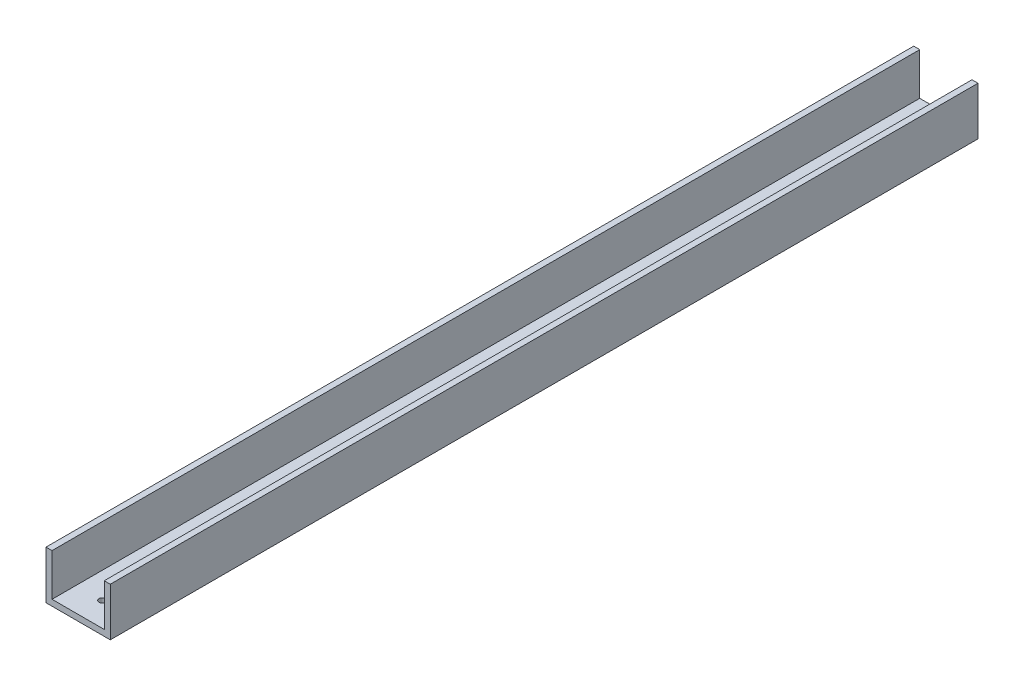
ISO-10303-21;
HEADER;
FILE_DESCRIPTION(('STEP AP214'),'2;1');
FILE_NAME('part.step','',(''),(''),'','','');
FILE_SCHEMA(('AUTOMOTIVE_DESIGN { 1 0 10303 214 1 1 1 1 }'));
ENDSEC;
DATA;
#1=APPLICATION_CONTEXT('core data for automotive mechanical design processes');
#2=APPLICATION_PROTOCOL_DEFINITION('international standard','automotive_design',2000,#1);
#3=PRODUCT_CONTEXT('',#1,'mechanical');
#4=PRODUCT('Part','Part','',(#3));
#5=PRODUCT_RELATED_PRODUCT_CATEGORY('part','',(#4));
#6=PRODUCT_DEFINITION_FORMATION('','',#4);
#7=PRODUCT_DEFINITION_CONTEXT('part definition',#1,'design');
#8=PRODUCT_DEFINITION('design','',#6,#7);
#9=PRODUCT_DEFINITION_SHAPE('','',#8);
#10=(LENGTH_UNIT() NAMED_UNIT(*) SI_UNIT(.MILLI.,.METRE.));
#11=(NAMED_UNIT(*) PLANE_ANGLE_UNIT() SI_UNIT($,.RADIAN.));
#12=(NAMED_UNIT(*) SI_UNIT($,.STERADIAN.) SOLID_ANGLE_UNIT());
#13=UNCERTAINTY_MEASURE_WITH_UNIT(LENGTH_MEASURE(1.E-05),#10,'distance_accuracy_value','');
#14=(GEOMETRIC_REPRESENTATION_CONTEXT(3) GLOBAL_UNCERTAINTY_ASSIGNED_CONTEXT((#13)) GLOBAL_UNIT_ASSIGNED_CONTEXT((#10,
#11,#12)) REPRESENTATION_CONTEXT('',''));
#15=CARTESIAN_POINT('',(0.,0.,0.));
#16=DIRECTION('',(0.,0.,1.));
#17=DIRECTION('',(1.,0.,0.));
#18=AXIS2_PLACEMENT_3D('',#15,#16,#17);
#19=CARTESIAN_POINT('',(-20.6375,38.1,-342.9));
#20=DIRECTION('',(0.,1.,0.));
#21=DIRECTION('',(-1.,0.,0.));
#22=AXIS2_PLACEMENT_3D('',#19,#20,#21);
#23=PLANE('',#22);
#24=DIRECTION('',(0.,0.,1.));
#25=VECTOR('',#24,1.);
#26=CARTESIAN_POINT('',(-25.4,38.1,-342.9));
#27=LINE('',#26,#25);
#28=CARTESIAN_POINT('',(-25.4,38.1,-342.9));
#29=VERTEX_POINT('',#28);
#30=CARTESIAN_POINT('',(-25.4,38.1,342.9));
#31=VERTEX_POINT('',#30);
#32=EDGE_CURVE('E95',#29,#31,#27,.T.);
#33=ORIENTED_EDGE('',*,*,#32,.T.);
#34=DIRECTION('',(-1.,0.,0.));
#35=VECTOR('',#34,1.);
#36=CARTESIAN_POINT('',(-20.6375,38.1,342.9));
#37=LINE('',#36,#35);
#38=CARTESIAN_POINT('',(-20.6375,38.1,342.9));
#39=VERTEX_POINT('',#38);
#40=EDGE_CURVE('E98',#39,#31,#37,.T.);
#41=ORIENTED_EDGE('',*,*,#40,.F.);
#42=DIRECTION('',(0.,0.,1.));
#43=VECTOR('',#42,1.);
#44=CARTESIAN_POINT('',(-20.6375,38.1,-342.9));
#45=LINE('',#44,#43);
#46=CARTESIAN_POINT('',(-20.6375,38.1,-342.9));
#47=VERTEX_POINT('',#46);
#48=EDGE_CURVE('E11',#47,#39,#45,.T.);
#49=ORIENTED_EDGE('',*,*,#48,.F.);
#50=DIRECTION('',(-1.,0.,0.));
#51=VECTOR('',#50,1.);
#52=CARTESIAN_POINT('',(-20.6375,38.1,-342.9));
#53=LINE('',#52,#51);
#54=EDGE_CURVE('E99',#47,#29,#53,.T.);
#55=ORIENTED_EDGE('',*,*,#54,.T.);
#56=EDGE_LOOP('',(#33,#41,#49,#55));
#57=FACE_BOUND('',#56,.T.);
#58=ADVANCED_FACE('F33',(#57),#23,.T.);
#59=CARTESIAN_POINT('',(-20.6375,4.76249999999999,-342.9));
#60=DIRECTION('',(1.,0.,0.));
#61=DIRECTION('',(0.,1.,0.));
#62=AXIS2_PLACEMENT_3D('',#59,#60,#61);
#63=PLANE('',#62);
#64=ORIENTED_EDGE('',*,*,#48,.T.);
#65=DIRECTION('',(0.,1.,0.));
#66=VECTOR('',#65,1.);
#67=CARTESIAN_POINT('',(-20.6375,4.76249999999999,342.9));
#68=LINE('',#67,#66);
#69=CARTESIAN_POINT('',(-20.6375,4.76249999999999,342.9));
#70=VERTEX_POINT('',#69);
#71=EDGE_CURVE('E116',#70,#39,#68,.T.);
#72=ORIENTED_EDGE('',*,*,#71,.F.);
#73=DIRECTION('',(0.,0.,1.));
#74=VECTOR('',#73,1.);
#75=CARTESIAN_POINT('',(-20.6375,4.76249999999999,-342.9));
#76=LINE('',#75,#74);
#77=CARTESIAN_POINT('',(-20.6375,4.76249999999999,-342.9));
#78=VERTEX_POINT('',#77);
#79=EDGE_CURVE('E41',#78,#70,#76,.T.);
#80=ORIENTED_EDGE('',*,*,#79,.F.);
#81=DIRECTION('',(0.,1.,0.));
#82=VECTOR('',#81,1.);
#83=CARTESIAN_POINT('',(-20.6375,4.76249999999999,-342.9));
#84=LINE('',#83,#82);
#85=EDGE_CURVE('E104',#78,#47,#84,.T.);
#86=ORIENTED_EDGE('',*,*,#85,.T.);
#87=EDGE_LOOP('',(#64,#72,#80,#86));
#88=FACE_BOUND('',#87,.T.);
#89=ADVANCED_FACE('F186',(#88),#63,.T.);
#90=CARTESIAN_POINT('',(20.6375,4.7625,-342.9));
#91=DIRECTION('',(0.,1.,0.));
#92=DIRECTION('',(-1.,0.,0.));
#93=AXIS2_PLACEMENT_3D('',#90,#91,#92);
#94=PLANE('',#93);
#95=CARTESIAN_POINT('',(0.,4.7625,323.85));
#96=DIRECTION('',(0.,1.,0.));
#97=DIRECTION('',(-1.,0.,0.));
#98=AXIS2_PLACEMENT_3D('',#95,#96,#97);
#99=CIRCLE('',#98,2.55269999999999);
#100=CARTESIAN_POINT('',(-2.55269999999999,4.7625,323.85));
#101=VERTEX_POINT('',#100);
#102=EDGE_CURVE('E236',#101,#101,#99,.T.);
#103=ORIENTED_EDGE('',*,*,#102,.F.);
#104=EDGE_LOOP('',(#103));
#105=FACE_BOUND('',#104,.T.);
#106=CARTESIAN_POINT('',(0.,4.7625,101.6));
#107=DIRECTION('',(0.,1.,0.));
#108=DIRECTION('',(-1.,0.,0.));
#109=AXIS2_PLACEMENT_3D('',#106,#107,#108);
#110=CIRCLE('',#109,2.55269999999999);
#111=CARTESIAN_POINT('',(-2.55269999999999,4.7625,101.6));
#112=VERTEX_POINT('',#111);
#113=EDGE_CURVE('E246',#112,#112,#110,.T.);
#114=ORIENTED_EDGE('',*,*,#113,.F.);
#115=EDGE_LOOP('',(#114));
#116=FACE_BOUND('',#115,.T.);
#117=CARTESIAN_POINT('',(0.,4.7625,-101.6));
#118=DIRECTION('',(0.,1.,0.));
#119=DIRECTION('',(-1.,0.,0.));
#120=AXIS2_PLACEMENT_3D('',#117,#118,#119);
#121=CIRCLE('',#120,2.55269999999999);
#122=CARTESIAN_POINT('',(-2.55269999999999,4.7625,-101.6));
#123=VERTEX_POINT('',#122);
#124=EDGE_CURVE('E36',#123,#123,#121,.T.);
#125=ORIENTED_EDGE('',*,*,#124,.F.);
#126=EDGE_LOOP('',(#125));
#127=FACE_BOUND('',#126,.T.);
#128=CARTESIAN_POINT('',(0.,4.7625,-323.85));
#129=DIRECTION('',(0.,1.,0.));
#130=DIRECTION('',(-1.,0.,0.));
#131=AXIS2_PLACEMENT_3D('',#128,#129,#130);
#132=CIRCLE('',#131,2.55269999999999);
#133=CARTESIAN_POINT('',(-2.55269999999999,4.7625,-323.85));
#134=VERTEX_POINT('',#133);
#135=EDGE_CURVE('E117',#134,#134,#132,.T.);
#136=ORIENTED_EDGE('',*,*,#135,.F.);
#137=EDGE_LOOP('',(#136));
#138=FACE_BOUND('',#137,.T.);
#139=ORIENTED_EDGE('',*,*,#79,.T.);
#140=DIRECTION('',(-1.,0.,0.));
#141=VECTOR('',#140,1.);
#142=CARTESIAN_POINT('',(20.6375,4.7625,342.9));
#143=LINE('',#142,#141);
#144=CARTESIAN_POINT('',(20.6375,4.7625,342.9));
#145=VERTEX_POINT('',#144);
#146=EDGE_CURVE('E134',#145,#70,#143,.T.);
#147=ORIENTED_EDGE('',*,*,#146,.F.);
#148=DIRECTION('',(0.,0.,1.));
#149=VECTOR('',#148,1.);
#150=CARTESIAN_POINT('',(20.6375,4.7625,-342.9));
#151=LINE('',#150,#149);
#152=CARTESIAN_POINT('',(20.6375,4.7625,-342.9));
#153=VERTEX_POINT('',#152);
#154=EDGE_CURVE('E156',#153,#145,#151,.T.);
#155=ORIENTED_EDGE('',*,*,#154,.F.);
#156=DIRECTION('',(-1.,0.,0.));
#157=VECTOR('',#156,1.);
#158=CARTESIAN_POINT('',(20.6375,4.7625,-342.9));
#159=LINE('',#158,#157);
#160=EDGE_CURVE('E152',#153,#78,#159,.T.);
#161=ORIENTED_EDGE('',*,*,#160,.T.);
#162=EDGE_LOOP('',(#139,#147,#155,#161));
#163=FACE_BOUND('',#162,.T.);
#164=ADVANCED_FACE('F185',(#105,#116,#127,#138,#163),#94,.T.);
#165=CARTESIAN_POINT('',(20.6375,38.1,-342.9));
#166=DIRECTION('',(-1.,0.,0.));
#167=DIRECTION('',(0.,-1.,0.));
#168=AXIS2_PLACEMENT_3D('',#165,#166,#167);
#169=PLANE('',#168);
#170=ORIENTED_EDGE('',*,*,#154,.T.);
#171=DIRECTION('',(0.,-1.,0.));
#172=VECTOR('',#171,1.);
#173=CARTESIAN_POINT('',(20.6375,38.1,342.9));
#174=LINE('',#173,#172);
#175=CARTESIAN_POINT('',(20.6375,38.1,342.9));
#176=VERTEX_POINT('',#175);
#177=EDGE_CURVE('E131',#176,#145,#174,.T.);
#178=ORIENTED_EDGE('',*,*,#177,.F.);
#179=DIRECTION('',(0.,0.,1.));
#180=VECTOR('',#179,1.);
#181=CARTESIAN_POINT('',(20.6375,38.1,-342.9));
#182=LINE('',#181,#180);
#183=CARTESIAN_POINT('',(20.6375,38.1,-342.9));
#184=VERTEX_POINT('',#183);
#185=EDGE_CURVE('E158',#184,#176,#182,.T.);
#186=ORIENTED_EDGE('',*,*,#185,.F.);
#187=DIRECTION('',(0.,-1.,0.));
#188=VECTOR('',#187,1.);
#189=CARTESIAN_POINT('',(20.6375,38.1,-342.9));
#190=LINE('',#189,#188);
#191=EDGE_CURVE('E149',#184,#153,#190,.T.);
#192=ORIENTED_EDGE('',*,*,#191,.T.);
#193=EDGE_LOOP('',(#170,#178,#186,#192));
#194=FACE_BOUND('',#193,.T.);
#195=ADVANCED_FACE('F181',(#194),#169,.T.);
#196=CARTESIAN_POINT('',(25.4,38.1,-342.9));
#197=DIRECTION('',(0.,1.,0.));
#198=DIRECTION('',(-1.,0.,0.));
#199=AXIS2_PLACEMENT_3D('',#196,#197,#198);
#200=PLANE('',#199);
#201=ORIENTED_EDGE('',*,*,#185,.T.);
#202=DIRECTION('',(-1.,0.,0.));
#203=VECTOR('',#202,1.);
#204=CARTESIAN_POINT('',(25.4,38.1,342.9));
#205=LINE('',#204,#203);
#206=CARTESIAN_POINT('',(25.4,38.1,342.9));
#207=VERTEX_POINT('',#206);
#208=EDGE_CURVE('E128',#207,#176,#205,.T.);
#209=ORIENTED_EDGE('',*,*,#208,.F.);
#210=DIRECTION('',(0.,0.,1.));
#211=VECTOR('',#210,1.);
#212=CARTESIAN_POINT('',(25.4,38.1,-342.9));
#213=LINE('',#212,#211);
#214=CARTESIAN_POINT('',(25.4,38.1,-342.9));
#215=VERTEX_POINT('',#214);
#216=EDGE_CURVE('E160',#215,#207,#213,.T.);
#217=ORIENTED_EDGE('',*,*,#216,.F.);
#218=DIRECTION('',(-1.,0.,0.));
#219=VECTOR('',#218,1.);
#220=CARTESIAN_POINT('',(25.4,38.1,-342.9));
#221=LINE('',#220,#219);
#222=EDGE_CURVE('E146',#215,#184,#221,.T.);
#223=ORIENTED_EDGE('',*,*,#222,.T.);
#224=EDGE_LOOP('',(#201,#209,#217,#223));
#225=FACE_BOUND('',#224,.T.);
#226=ADVANCED_FACE('F174',(#225),#200,.T.);
#227=CARTESIAN_POINT('',(25.4,0.,-342.9));
#228=DIRECTION('',(1.,0.,0.));
#229=DIRECTION('',(0.,1.,0.));
#230=AXIS2_PLACEMENT_3D('',#227,#228,#229);
#231=PLANE('',#230);
#232=ORIENTED_EDGE('',*,*,#216,.T.);
#233=DIRECTION('',(0.,1.,0.));
#234=VECTOR('',#233,1.);
#235=CARTESIAN_POINT('',(25.4,0.,342.9));
#236=LINE('',#235,#234);
#237=CARTESIAN_POINT('',(25.4,0.,342.9));
#238=VERTEX_POINT('',#237);
#239=EDGE_CURVE('E125',#238,#207,#236,.T.);
#240=ORIENTED_EDGE('',*,*,#239,.F.);
#241=DIRECTION('',(0.,0.,1.));
#242=VECTOR('',#241,1.);
#243=CARTESIAN_POINT('',(25.4,0.,-342.9));
#244=LINE('',#243,#242);
#245=CARTESIAN_POINT('',(25.4,0.,-342.9));
#246=VERTEX_POINT('',#245);
#247=EDGE_CURVE('E162',#246,#238,#244,.T.);
#248=ORIENTED_EDGE('',*,*,#247,.F.);
#249=DIRECTION('',(0.,1.,0.));
#250=VECTOR('',#249,1.);
#251=CARTESIAN_POINT('',(25.4,0.,-342.9));
#252=LINE('',#251,#250);
#253=EDGE_CURVE('E143',#246,#215,#252,.T.);
#254=ORIENTED_EDGE('',*,*,#253,.T.);
#255=EDGE_LOOP('',(#232,#240,#248,#254));
#256=FACE_BOUND('',#255,.T.);
#257=ADVANCED_FACE('F171',(#256),#231,.T.);
#258=CARTESIAN_POINT('',(-25.4,0.,-342.9));
#259=DIRECTION('',(0.,-1.,0.));
#260=DIRECTION('',(1.,0.,0.));
#261=AXIS2_PLACEMENT_3D('',#258,#259,#260);
#262=PLANE('',#261);
#263=CARTESIAN_POINT('',(0.,0.,323.85));
#264=DIRECTION('',(0.,-1.,0.));
#265=DIRECTION('',(0.,0.,-1.));
#266=AXIS2_PLACEMENT_3D('',#263,#264,#265);
#267=CIRCLE('',#266,2.55269999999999);
#268=CARTESIAN_POINT('',(0.,0.,321.2973));
#269=VERTEX_POINT('',#268);
#270=EDGE_CURVE('E239',#269,#269,#267,.T.);
#271=ORIENTED_EDGE('',*,*,#270,.F.);
#272=EDGE_LOOP('',(#271));
#273=FACE_BOUND('',#272,.T.);
#274=CARTESIAN_POINT('',(0.,0.,101.6));
#275=DIRECTION('',(0.,-1.,0.));
#276=DIRECTION('',(0.,0.,-1.));
#277=AXIS2_PLACEMENT_3D('',#274,#275,#276);
#278=CIRCLE('',#277,2.55269999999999);
#279=CARTESIAN_POINT('',(0.,0.,99.0473));
#280=VERTEX_POINT('',#279);
#281=EDGE_CURVE('E241',#280,#280,#278,.T.);
#282=ORIENTED_EDGE('',*,*,#281,.F.);
#283=EDGE_LOOP('',(#282));
#284=FACE_BOUND('',#283,.T.);
#285=CARTESIAN_POINT('',(0.,0.,-101.6));
#286=DIRECTION('',(0.,-1.,0.));
#287=DIRECTION('',(0.,0.,-1.));
#288=AXIS2_PLACEMENT_3D('',#285,#286,#287);
#289=CIRCLE('',#288,2.55269999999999);
#290=CARTESIAN_POINT('',(0.,0.,-104.1527));
#291=VERTEX_POINT('',#290);
#292=EDGE_CURVE('E249',#291,#291,#289,.T.);
#293=ORIENTED_EDGE('',*,*,#292,.F.);
#294=EDGE_LOOP('',(#293));
#295=FACE_BOUND('',#294,.T.);
#296=CARTESIAN_POINT('',(0.,0.,-323.85));
#297=DIRECTION('',(0.,-1.,0.));
#298=DIRECTION('',(0.,0.,-1.));
#299=AXIS2_PLACEMENT_3D('',#296,#297,#298);
#300=CIRCLE('',#299,2.55269999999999);
#301=CARTESIAN_POINT('',(0.,0.,-326.4027));
#302=VERTEX_POINT('',#301);
#303=EDGE_CURVE('E120',#302,#302,#300,.T.);
#304=ORIENTED_EDGE('',*,*,#303,.F.);
#305=EDGE_LOOP('',(#304));
#306=FACE_BOUND('',#305,.T.);
#307=ORIENTED_EDGE('',*,*,#247,.T.);
#308=DIRECTION('',(1.,0.,0.));
#309=VECTOR('',#308,1.);
#310=CARTESIAN_POINT('',(-25.4,0.,342.9));
#311=LINE('',#310,#309);
#312=CARTESIAN_POINT('',(-25.4,0.,342.9));
#313=VERTEX_POINT('',#312);
#314=EDGE_CURVE('E111',#313,#238,#311,.T.);
#315=ORIENTED_EDGE('',*,*,#314,.F.);
#316=DIRECTION('',(0.,0.,1.));
#317=VECTOR('',#316,1.);
#318=CARTESIAN_POINT('',(-25.4,0.,-342.9));
#319=LINE('',#318,#317);
#320=CARTESIAN_POINT('',(-25.4,0.,-342.9));
#321=VERTEX_POINT('',#320);
#322=EDGE_CURVE('E103',#321,#313,#319,.T.);
#323=ORIENTED_EDGE('',*,*,#322,.F.);
#324=DIRECTION('',(1.,0.,0.));
#325=VECTOR('',#324,1.);
#326=CARTESIAN_POINT('',(-25.4,0.,-342.9));
#327=LINE('',#326,#325);
#328=EDGE_CURVE('E140',#321,#246,#327,.T.);
#329=ORIENTED_EDGE('',*,*,#328,.T.);
#330=EDGE_LOOP('',(#307,#315,#323,#329));
#331=FACE_BOUND('',#330,.T.);
#332=ADVANCED_FACE('F165',(#273,#284,#295,#306,#331),#262,.T.);
#333=CARTESIAN_POINT('',(-25.4,38.1,-342.9));
#334=DIRECTION('',(-1.,0.,0.));
#335=DIRECTION('',(0.,-1.,0.));
#336=AXIS2_PLACEMENT_3D('',#333,#334,#335);
#337=PLANE('',#336);
#338=ORIENTED_EDGE('',*,*,#322,.T.);
#339=DIRECTION('',(0.,-1.,0.));
#340=VECTOR('',#339,1.);
#341=CARTESIAN_POINT('',(-25.4,38.1,342.9));
#342=LINE('',#341,#340);
#343=EDGE_CURVE('E106',#31,#313,#342,.T.);
#344=ORIENTED_EDGE('',*,*,#343,.F.);
#345=ORIENTED_EDGE('',*,*,#32,.F.);
#346=DIRECTION('',(0.,-1.,0.));
#347=VECTOR('',#346,1.);
#348=CARTESIAN_POINT('',(-25.4,38.1,-342.9));
#349=LINE('',#348,#347);
#350=EDGE_CURVE('E138',#29,#321,#349,.T.);
#351=ORIENTED_EDGE('',*,*,#350,.T.);
#352=EDGE_LOOP('',(#338,#344,#345,#351));
#353=FACE_BOUND('',#352,.T.);
#354=ADVANCED_FACE('F107',(#353),#337,.T.);
#355=CARTESIAN_POINT('',(0.,0.,-342.9));
#356=DIRECTION('',(0.,0.,1.));
#357=DIRECTION('',(1.,0.,0.));
#358=AXIS2_PLACEMENT_3D('',#355,#356,#357);
#359=PLANE('',#358);
#360=ORIENTED_EDGE('',*,*,#54,.F.);
#361=ORIENTED_EDGE('',*,*,#85,.F.);
#362=ORIENTED_EDGE('',*,*,#160,.F.);
#363=ORIENTED_EDGE('',*,*,#191,.F.);
#364=ORIENTED_EDGE('',*,*,#222,.F.);
#365=ORIENTED_EDGE('',*,*,#253,.F.);
#366=ORIENTED_EDGE('',*,*,#328,.F.);
#367=ORIENTED_EDGE('',*,*,#350,.F.);
#368=EDGE_LOOP('',(#360,#361,#362,#363,#364,#365,#366,#367));
#369=FACE_BOUND('',#368,.T.);
#370=ADVANCED_FACE('F177',(#369),#359,.F.);
#371=CARTESIAN_POINT('',(0.,0.,342.9));
#372=DIRECTION('',(0.,0.,1.));
#373=DIRECTION('',(1.,0.,0.));
#374=AXIS2_PLACEMENT_3D('',#371,#372,#373);
#375=PLANE('',#374);
#376=ORIENTED_EDGE('',*,*,#40,.T.);
#377=ORIENTED_EDGE('',*,*,#343,.T.);
#378=ORIENTED_EDGE('',*,*,#314,.T.);
#379=ORIENTED_EDGE('',*,*,#239,.T.);
#380=ORIENTED_EDGE('',*,*,#208,.T.);
#381=ORIENTED_EDGE('',*,*,#177,.T.);
#382=ORIENTED_EDGE('',*,*,#146,.T.);
#383=ORIENTED_EDGE('',*,*,#71,.T.);
#384=EDGE_LOOP('',(#376,#377,#378,#379,#380,#381,#382,#383));
#385=FACE_BOUND('',#384,.T.);
#386=ADVANCED_FACE('F114',(#385),#375,.T.);
#387=CARTESIAN_POINT('',(0.,0.,-323.85));
#388=DIRECTION('',(0.,-1.,0.));
#389=DIRECTION('',(0.,0.,-1.));
#390=AXIS2_PLACEMENT_3D('',#387,#388,#389);
#391=CYLINDRICAL_SURFACE('',#390,2.55269999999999);
#392=ORIENTED_EDGE('',*,*,#135,.T.);
#393=EDGE_LOOP('',(#392));
#394=FACE_BOUND('',#393,.T.);
#395=ORIENTED_EDGE('',*,*,#303,.T.);
#396=EDGE_LOOP('',(#395));
#397=FACE_BOUND('',#396,.T.);
#398=ADVANCED_FACE('F213',(#394,#397),#391,.F.);
#399=CARTESIAN_POINT('',(0.,0.,-101.6));
#400=DIRECTION('',(0.,-1.,0.));
#401=DIRECTION('',(0.,0.,-1.));
#402=AXIS2_PLACEMENT_3D('',#399,#400,#401);
#403=CYLINDRICAL_SURFACE('',#402,2.55269999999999);
#404=ORIENTED_EDGE('',*,*,#124,.T.);
#405=EDGE_LOOP('',(#404));
#406=FACE_BOUND('',#405,.T.);
#407=ORIENTED_EDGE('',*,*,#292,.T.);
#408=EDGE_LOOP('',(#407));
#409=FACE_BOUND('',#408,.T.);
#410=ADVANCED_FACE('F217',(#406,#409),#403,.F.);
#411=CARTESIAN_POINT('',(0.,0.,101.6));
#412=DIRECTION('',(0.,-1.,0.));
#413=DIRECTION('',(0.,0.,-1.));
#414=AXIS2_PLACEMENT_3D('',#411,#412,#413);
#415=CYLINDRICAL_SURFACE('',#414,2.55269999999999);
#416=ORIENTED_EDGE('',*,*,#113,.T.);
#417=EDGE_LOOP('',(#416));
#418=FACE_BOUND('',#417,.T.);
#419=ORIENTED_EDGE('',*,*,#281,.T.);
#420=EDGE_LOOP('',(#419));
#421=FACE_BOUND('',#420,.T.);
#422=ADVANCED_FACE('F223',(#418,#421),#415,.F.);
#423=CARTESIAN_POINT('',(0.,0.,323.85));
#424=DIRECTION('',(0.,-1.,0.));
#425=DIRECTION('',(0.,0.,-1.));
#426=AXIS2_PLACEMENT_3D('',#423,#424,#425);
#427=CYLINDRICAL_SURFACE('',#426,2.55269999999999);
#428=ORIENTED_EDGE('',*,*,#102,.T.);
#429=EDGE_LOOP('',(#428));
#430=FACE_BOUND('',#429,.T.);
#431=ORIENTED_EDGE('',*,*,#270,.T.);
#432=EDGE_LOOP('',(#431));
#433=FACE_BOUND('',#432,.T.);
#434=ADVANCED_FACE('F227',(#430,#433),#427,.F.);
#435=CLOSED_SHELL('',(#58,#89,#164,#195,#226,#257,#332,#354,#370,#386,#398,#410,#422,#434));
#436=MANIFOLD_SOLID_BREP('B2',#435);
#437=ADVANCED_BREP_SHAPE_REPRESENTATION('',(#18,#436),#14);
#438=SHAPE_DEFINITION_REPRESENTATION(#9,#437);
ENDSEC;
END-ISO-10303-21;
